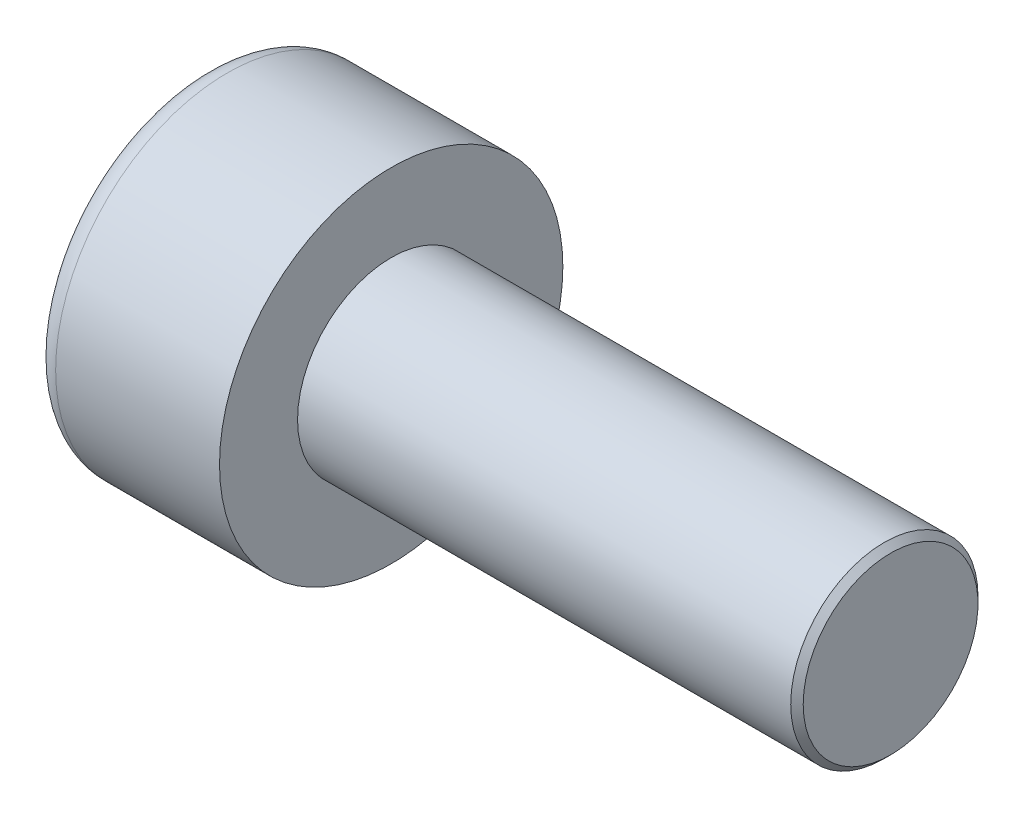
ISO-10303-21;
HEADER;
FILE_DESCRIPTION(('STEP AP214'),'2;1');
FILE_NAME('part.step','',(''),(''),'','','');
FILE_SCHEMA(('AUTOMOTIVE_DESIGN { 1 0 10303 214 1 1 1 1 }'));
ENDSEC;
DATA;
#1=APPLICATION_CONTEXT('core data for automotive mechanical design processes');
#2=APPLICATION_PROTOCOL_DEFINITION('international standard','automotive_design',2000,#1);
#3=PRODUCT_CONTEXT('',#1,'mechanical');
#4=PRODUCT('Part','Part','',(#3));
#5=PRODUCT_RELATED_PRODUCT_CATEGORY('part','',(#4));
#6=PRODUCT_DEFINITION_FORMATION('','',#4);
#7=PRODUCT_DEFINITION_CONTEXT('part definition',#1,'design');
#8=PRODUCT_DEFINITION('design','',#6,#7);
#9=PRODUCT_DEFINITION_SHAPE('','',#8);
#10=(LENGTH_UNIT() NAMED_UNIT(*) SI_UNIT(.MILLI.,.METRE.));
#11=(NAMED_UNIT(*) PLANE_ANGLE_UNIT() SI_UNIT($,.RADIAN.));
#12=(NAMED_UNIT(*) SI_UNIT($,.STERADIAN.) SOLID_ANGLE_UNIT());
#13=UNCERTAINTY_MEASURE_WITH_UNIT(LENGTH_MEASURE(1.E-05),#10,'distance_accuracy_value','');
#14=(GEOMETRIC_REPRESENTATION_CONTEXT(3) GLOBAL_UNCERTAINTY_ASSIGNED_CONTEXT((#13)) GLOBAL_UNIT_ASSIGNED_CONTEXT((#10,
#11,#12)) REPRESENTATION_CONTEXT('',''));
#15=CARTESIAN_POINT('',(0.,0.,0.));
#16=DIRECTION('',(0.,0.,1.));
#17=DIRECTION('',(1.,0.,0.));
#18=AXIS2_PLACEMENT_3D('',#15,#16,#17);
#19=CARTESIAN_POINT('',(1.30000000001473,0.,0.));
#20=DIRECTION('',(-1.,0.,0.));
#21=DIRECTION('',(0.,0.,1.));
#22=AXIS2_PLACEMENT_3D('',#19,#20,#21);
#23=CONICAL_SURFACE('',#22,1.25000000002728,1.04719755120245);
#24=CARTESIAN_POINT('',(2.02168783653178,0.,0.));
#25=VERTEX_POINT('',#24);
#26=VERTEX_LOOP('',#25);
#27=FACE_BOUND('',#26,.T.);
#28=CARTESIAN_POINT('',(1.30000000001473,0.,0.));
#29=DIRECTION('',(-1.,0.,0.));
#30=DIRECTION('',(0.,0.,1.));
#31=AXIS2_PLACEMENT_3D('',#28,#29,#30);
#32=CIRCLE('',#31,1.25000000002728);
#33=CARTESIAN_POINT('',(1.30000000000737,-0.625000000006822,1.08253175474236));
#34=VERTEX_POINT('',#33);
#35=CARTESIAN_POINT('',(1.30000000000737,0.625000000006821,1.08253175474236));
#36=VERTEX_POINT('',#35);
#37=EDGE_CURVE('E85',#34,#36,#32,.T.);
#38=ORIENTED_EDGE('',*,*,#37,.T.);
#39=CARTESIAN_POINT('',(1.30000000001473,0.,0.));
#40=DIRECTION('',(-1.,0.,0.));
#41=DIRECTION('',(0.,0.,1.));
#42=AXIS2_PLACEMENT_3D('',#39,#40,#41);
#43=CIRCLE('',#42,1.25000000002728);
#44=CARTESIAN_POINT('',(1.30000000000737,1.25000000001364,0.));
#45=VERTEX_POINT('',#44);
#46=EDGE_CURVE('E103',#36,#45,#43,.T.);
#47=ORIENTED_EDGE('',*,*,#46,.T.);
#48=CARTESIAN_POINT('',(1.30000000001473,0.,0.));
#49=DIRECTION('',(-1.,0.,0.));
#50=DIRECTION('',(0.,0.,1.));
#51=AXIS2_PLACEMENT_3D('',#48,#49,#50);
#52=CIRCLE('',#51,1.25000000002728);
#53=CARTESIAN_POINT('',(1.30000000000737,0.625000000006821,-1.08253175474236));
#54=VERTEX_POINT('',#53);
#55=EDGE_CURVE('E147',#45,#54,#52,.T.);
#56=ORIENTED_EDGE('',*,*,#55,.T.);
#57=CARTESIAN_POINT('',(1.30000000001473,0.,0.));
#58=DIRECTION('',(-1.,0.,0.));
#59=DIRECTION('',(0.,0.,1.));
#60=AXIS2_PLACEMENT_3D('',#57,#58,#59);
#61=CIRCLE('',#60,1.25000000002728);
#62=CARTESIAN_POINT('',(1.30000000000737,-0.625000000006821,-1.08253175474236));
#63=VERTEX_POINT('',#62);
#64=EDGE_CURVE('E135',#54,#63,#61,.T.);
#65=ORIENTED_EDGE('',*,*,#64,.T.);
#66=CARTESIAN_POINT('',(1.30000000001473,0.,0.));
#67=DIRECTION('',(-1.,0.,0.));
#68=DIRECTION('',(0.,0.,1.));
#69=AXIS2_PLACEMENT_3D('',#66,#67,#68);
#70=CIRCLE('',#69,1.25000000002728);
#71=CARTESIAN_POINT('',(1.30000000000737,-1.25000000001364,0.));
#72=VERTEX_POINT('',#71);
#73=EDGE_CURVE('E89',#63,#72,#70,.T.);
#74=ORIENTED_EDGE('',*,*,#73,.T.);
#75=CARTESIAN_POINT('',(1.30000000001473,0.,0.));
#76=DIRECTION('',(-1.,0.,0.));
#77=DIRECTION('',(0.,0.,1.));
#78=AXIS2_PLACEMENT_3D('',#75,#76,#77);
#79=CIRCLE('',#78,1.25000000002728);
#80=EDGE_CURVE('E83',#72,#34,#79,.T.);
#81=ORIENTED_EDGE('',*,*,#80,.T.);
#82=EDGE_LOOP('',(#38,#47,#56,#65,#74,#81));
#83=FACE_BOUND('',#82,.T.);
#84=ADVANCED_FACE('F17',(#27,#83),#23,.F.);
#85=CARTESIAN_POINT('',(1.3,0.,-1.44337567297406));
#86=DIRECTION('',(1.,0.,0.));
#87=DIRECTION('',(0.,0.,-1.));
#88=AXIS2_PLACEMENT_3D('',#85,#86,#87);
#89=PLANE('',#88);
#90=DIRECTION('',(0.,0.,1.));
#91=VECTOR('',#90,1.);
#92=CARTESIAN_POINT('',(1.3,-1.25,0.721687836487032));
#93=LINE('',#92,#91);
#94=CARTESIAN_POINT('',(1.3,-1.25,0.721687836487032));
#95=VERTEX_POINT('',#94);
#96=EDGE_CURVE('E109',#95,#72,#93,.F.);
#97=ORIENTED_EDGE('',*,*,#96,.F.);
#98=DIRECTION('',(0.,0.866025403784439,0.5));
#99=VECTOR('',#98,1.);
#100=CARTESIAN_POINT('',(1.3,0.,1.44337567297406));
#101=LINE('',#100,#99);
#102=EDGE_CURVE('E106',#34,#95,#101,.F.);
#103=ORIENTED_EDGE('',*,*,#102,.F.);
#104=ORIENTED_EDGE('',*,*,#80,.F.);
#105=EDGE_LOOP('',(#97,#103,#104));
#106=FACE_BOUND('',#105,.T.);
#107=ADVANCED_FACE('F107',(#106),#89,.F.);
#108=CARTESIAN_POINT('',(1.3,0.,-1.44337567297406));
#109=DIRECTION('',(1.,0.,0.));
#110=DIRECTION('',(0.,0.,-1.));
#111=AXIS2_PLACEMENT_3D('',#108,#109,#110);
#112=PLANE('',#111);
#113=DIRECTION('',(0.,0.866025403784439,0.5));
#114=VECTOR('',#113,1.);
#115=CARTESIAN_POINT('',(1.3,0.,1.44337567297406));
#116=LINE('',#115,#114);
#117=CARTESIAN_POINT('',(1.3,0.,1.44337567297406));
#118=VERTEX_POINT('',#117);
#119=EDGE_CURVE('E98',#118,#34,#116,.F.);
#120=ORIENTED_EDGE('',*,*,#119,.F.);
#121=DIRECTION('',(0.,0.866025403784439,-0.5));
#122=VECTOR('',#121,1.);
#123=CARTESIAN_POINT('',(1.3,1.25,0.721687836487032));
#124=LINE('',#123,#122);
#125=EDGE_CURVE('E101',#36,#118,#124,.F.);
#126=ORIENTED_EDGE('',*,*,#125,.F.);
#127=ORIENTED_EDGE('',*,*,#37,.F.);
#128=EDGE_LOOP('',(#120,#126,#127));
#129=FACE_BOUND('',#128,.T.);
#130=ADVANCED_FACE('F96',(#129),#112,.F.);
#131=CARTESIAN_POINT('',(1.3,0.,-1.44337567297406));
#132=DIRECTION('',(1.,0.,0.));
#133=DIRECTION('',(0.,0.,-1.));
#134=AXIS2_PLACEMENT_3D('',#131,#132,#133);
#135=PLANE('',#134);
#136=DIRECTION('',(0.,0.866025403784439,-0.5));
#137=VECTOR('',#136,1.);
#138=CARTESIAN_POINT('',(1.3,1.25,0.721687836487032));
#139=LINE('',#138,#137);
#140=CARTESIAN_POINT('',(1.3,1.25,0.721687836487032));
#141=VERTEX_POINT('',#140);
#142=EDGE_CURVE('E131',#141,#36,#139,.F.);
#143=ORIENTED_EDGE('',*,*,#142,.F.);
#144=DIRECTION('',(0.,0.,-1.));
#145=VECTOR('',#144,1.);
#146=CARTESIAN_POINT('',(1.3,1.25,-0.721687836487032));
#147=LINE('',#146,#145);
#148=EDGE_CURVE('E192',#45,#141,#147,.F.);
#149=ORIENTED_EDGE('',*,*,#148,.F.);
#150=ORIENTED_EDGE('',*,*,#46,.F.);
#151=EDGE_LOOP('',(#143,#149,#150));
#152=FACE_BOUND('',#151,.T.);
#153=ADVANCED_FACE('F401',(#152),#135,.F.);
#154=CARTESIAN_POINT('',(1.3,0.,-1.44337567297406));
#155=DIRECTION('',(1.,0.,0.));
#156=DIRECTION('',(0.,0.,-1.));
#157=AXIS2_PLACEMENT_3D('',#154,#155,#156);
#158=PLANE('',#157);
#159=DIRECTION('',(0.,0.,-1.));
#160=VECTOR('',#159,1.);
#161=CARTESIAN_POINT('',(1.3,1.25,-0.721687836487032));
#162=LINE('',#161,#160);
#163=CARTESIAN_POINT('',(1.3,1.25,-0.721687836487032));
#164=VERTEX_POINT('',#163);
#165=EDGE_CURVE('E189',#164,#45,#162,.F.);
#166=ORIENTED_EDGE('',*,*,#165,.F.);
#167=DIRECTION('',(0.,-0.866025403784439,-0.5));
#168=VECTOR('',#167,1.);
#169=CARTESIAN_POINT('',(1.3,0.,-1.44337567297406));
#170=LINE('',#169,#168);
#171=EDGE_CURVE('E177',#54,#164,#170,.F.);
#172=ORIENTED_EDGE('',*,*,#171,.F.);
#173=ORIENTED_EDGE('',*,*,#55,.F.);
#174=EDGE_LOOP('',(#166,#172,#173));
#175=FACE_BOUND('',#174,.T.);
#176=ADVANCED_FACE('F391',(#175),#158,.F.);
#177=CARTESIAN_POINT('',(1.3,0.,-1.44337567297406));
#178=DIRECTION('',(1.,0.,0.));
#179=DIRECTION('',(0.,0.,-1.));
#180=AXIS2_PLACEMENT_3D('',#177,#178,#179);
#181=PLANE('',#180);
#182=DIRECTION('',(0.,-0.866025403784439,0.5));
#183=VECTOR('',#182,1.);
#184=CARTESIAN_POINT('',(1.3,-1.25,-0.721687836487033));
#185=LINE('',#184,#183);
#186=CARTESIAN_POINT('',(1.3,-1.25,-0.721687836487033));
#187=VERTEX_POINT('',#186);
#188=EDGE_CURVE('E231',#187,#63,#185,.F.);
#189=ORIENTED_EDGE('',*,*,#188,.F.);
#190=DIRECTION('',(0.,0.,1.));
#191=VECTOR('',#190,1.);
#192=CARTESIAN_POINT('',(1.3,-1.25,0.721687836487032));
#193=LINE('',#192,#191);
#194=EDGE_CURVE('E119',#72,#187,#193,.F.);
#195=ORIENTED_EDGE('',*,*,#194,.F.);
#196=ORIENTED_EDGE('',*,*,#73,.F.);
#197=EDGE_LOOP('',(#189,#195,#196));
#198=FACE_BOUND('',#197,.T.);
#199=ADVANCED_FACE('F381',(#198),#181,.F.);
#200=CARTESIAN_POINT('',(1.3,0.,-1.44337567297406));
#201=DIRECTION('',(1.,0.,0.));
#202=DIRECTION('',(0.,0.,-1.));
#203=AXIS2_PLACEMENT_3D('',#200,#201,#202);
#204=PLANE('',#203);
#205=DIRECTION('',(0.,-0.866025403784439,-0.5));
#206=VECTOR('',#205,1.);
#207=CARTESIAN_POINT('',(1.3,0.,-1.44337567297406));
#208=LINE('',#207,#206);
#209=CARTESIAN_POINT('',(1.3,0.,-1.44337567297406));
#210=VERTEX_POINT('',#209);
#211=EDGE_CURVE('E181',#210,#54,#208,.F.);
#212=ORIENTED_EDGE('',*,*,#211,.F.);
#213=DIRECTION('',(0.,-0.866025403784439,0.5));
#214=VECTOR('',#213,1.);
#215=CARTESIAN_POINT('',(1.3,-1.25,-0.721687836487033));
#216=LINE('',#215,#214);
#217=EDGE_CURVE('E449',#63,#210,#216,.F.);
#218=ORIENTED_EDGE('',*,*,#217,.F.);
#219=ORIENTED_EDGE('',*,*,#64,.F.);
#220=EDGE_LOOP('',(#212,#218,#219));
#221=FACE_BOUND('',#220,.T.);
#222=ADVANCED_FACE('F371',(#221),#204,.F.);
#223=CARTESIAN_POINT('',(1.3,-1.25,0.721687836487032));
#224=DIRECTION('',(0.,1.,0.));
#225=DIRECTION('',(0.,0.,1.));
#226=AXIS2_PLACEMENT_3D('',#223,#224,#225);
#227=PLANE('',#226);
#228=ORIENTED_EDGE('',*,*,#194,.T.);
#229=DIRECTION('',(1.,0.,0.));
#230=VECTOR('',#229,1.);
#231=CARTESIAN_POINT('',(1.3,-1.25,-0.721687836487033));
#232=LINE('',#231,#230);
#233=CARTESIAN_POINT('',(0.,-1.25,-0.721687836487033));
#234=VERTEX_POINT('',#233);
#235=EDGE_CURVE('E186',#234,#187,#232,.T.);
#236=ORIENTED_EDGE('',*,*,#235,.F.);
#237=DIRECTION('',(0.,0.,-1.));
#238=VECTOR('',#237,1.);
#239=CARTESIAN_POINT('',(0.,-1.25,0.));
#240=LINE('',#239,#238);
#241=CARTESIAN_POINT('',(0.,-1.25,0.721687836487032));
#242=VERTEX_POINT('',#241);
#243=EDGE_CURVE('E170',#234,#242,#240,.F.);
#244=ORIENTED_EDGE('',*,*,#243,.T.);
#245=DIRECTION('',(1.,0.,0.));
#246=VECTOR('',#245,1.);
#247=CARTESIAN_POINT('',(1.3,-1.25,0.721687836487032));
#248=LINE('',#247,#246);
#249=EDGE_CURVE('E113',#95,#242,#248,.F.);
#250=ORIENTED_EDGE('',*,*,#249,.F.);
#251=ORIENTED_EDGE('',*,*,#96,.T.);
#252=EDGE_LOOP('',(#228,#236,#244,#250,#251));
#253=FACE_BOUND('',#252,.T.);
#254=ADVANCED_FACE('F362',(#253),#227,.T.);
#255=CARTESIAN_POINT('',(1.3,0.,1.44337567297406));
#256=DIRECTION('',(0.,0.5,-0.866025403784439));
#257=DIRECTION('',(0.,0.866025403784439,0.5));
#258=AXIS2_PLACEMENT_3D('',#255,#256,#257);
#259=PLANE('',#258);
#260=ORIENTED_EDGE('',*,*,#102,.T.);
#261=ORIENTED_EDGE('',*,*,#249,.T.);
#262=DIRECTION('',(0.,0.866025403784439,0.5));
#263=VECTOR('',#262,1.);
#264=CARTESIAN_POINT('',(0.,-1.25,0.721687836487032));
#265=LINE('',#264,#263);
#266=CARTESIAN_POINT('',(0.,0.,1.44337567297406));
#267=VERTEX_POINT('',#266);
#268=EDGE_CURVE('E173',#242,#267,#265,.T.);
#269=ORIENTED_EDGE('',*,*,#268,.T.);
#270=DIRECTION('',(1.,0.,0.));
#271=VECTOR('',#270,1.);
#272=CARTESIAN_POINT('',(1.3,0.,1.44337567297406));
#273=LINE('',#272,#271);
#274=EDGE_CURVE('E118',#118,#267,#273,.F.);
#275=ORIENTED_EDGE('',*,*,#274,.F.);
#276=ORIENTED_EDGE('',*,*,#119,.T.);
#277=EDGE_LOOP('',(#260,#261,#269,#275,#276));
#278=FACE_BOUND('',#277,.T.);
#279=ADVANCED_FACE('F115',(#278),#259,.T.);
#280=CARTESIAN_POINT('',(1.3,1.25,0.721687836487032));
#281=DIRECTION('',(0.,-0.5,-0.866025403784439));
#282=DIRECTION('',(0.,0.866025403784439,-0.5));
#283=AXIS2_PLACEMENT_3D('',#280,#281,#282);
#284=PLANE('',#283);
#285=ORIENTED_EDGE('',*,*,#125,.T.);
#286=ORIENTED_EDGE('',*,*,#274,.T.);
#287=DIRECTION('',(0.,0.866025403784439,-0.5));
#288=VECTOR('',#287,1.);
#289=CARTESIAN_POINT('',(0.,0.,1.44337567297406));
#290=LINE('',#289,#288);
#291=CARTESIAN_POINT('',(0.,1.25,0.721687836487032));
#292=VERTEX_POINT('',#291);
#293=EDGE_CURVE('E216',#267,#292,#290,.T.);
#294=ORIENTED_EDGE('',*,*,#293,.T.);
#295=DIRECTION('',(1.,0.,0.));
#296=VECTOR('',#295,1.);
#297=CARTESIAN_POINT('',(1.3,1.25,0.721687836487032));
#298=LINE('',#297,#296);
#299=EDGE_CURVE('E197',#141,#292,#298,.F.);
#300=ORIENTED_EDGE('',*,*,#299,.F.);
#301=ORIENTED_EDGE('',*,*,#142,.T.);
#302=EDGE_LOOP('',(#285,#286,#294,#300,#301));
#303=FACE_BOUND('',#302,.T.);
#304=ADVANCED_FACE('F213',(#303),#284,.T.);
#305=CARTESIAN_POINT('',(1.3,1.25,-0.721687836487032));
#306=DIRECTION('',(0.,-1.,0.));
#307=DIRECTION('',(0.,0.,-1.));
#308=AXIS2_PLACEMENT_3D('',#305,#306,#307);
#309=PLANE('',#308);
#310=ORIENTED_EDGE('',*,*,#148,.T.);
#311=ORIENTED_EDGE('',*,*,#299,.T.);
#312=DIRECTION('',(0.,0.,-1.));
#313=VECTOR('',#312,1.);
#314=CARTESIAN_POINT('',(0.,1.25,0.));
#315=LINE('',#314,#313);
#316=CARTESIAN_POINT('',(0.,1.25,-0.721687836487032));
#317=VERTEX_POINT('',#316);
#318=EDGE_CURVE('E163',#292,#317,#315,.T.);
#319=ORIENTED_EDGE('',*,*,#318,.T.);
#320=DIRECTION('',(1.,0.,0.));
#321=VECTOR('',#320,1.);
#322=CARTESIAN_POINT('',(1.3,1.25,-0.721687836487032));
#323=LINE('',#322,#321);
#324=EDGE_CURVE('E180',#164,#317,#323,.F.);
#325=ORIENTED_EDGE('',*,*,#324,.F.);
#326=ORIENTED_EDGE('',*,*,#165,.T.);
#327=EDGE_LOOP('',(#310,#311,#319,#325,#326));
#328=FACE_BOUND('',#327,.T.);
#329=ADVANCED_FACE('F335',(#328),#309,.T.);
#330=CARTESIAN_POINT('',(1.3,0.,-1.44337567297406));
#331=DIRECTION('',(0.,-0.5,0.866025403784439));
#332=DIRECTION('',(0.,-0.866025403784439,-0.5));
#333=AXIS2_PLACEMENT_3D('',#330,#331,#332);
#334=PLANE('',#333);
#335=ORIENTED_EDGE('',*,*,#171,.T.);
#336=ORIENTED_EDGE('',*,*,#324,.T.);
#337=DIRECTION('',(0.,-0.866025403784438,-0.5));
#338=VECTOR('',#337,1.);
#339=CARTESIAN_POINT('',(0.,1.25,-0.721687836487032));
#340=LINE('',#339,#338);
#341=CARTESIAN_POINT('',(0.,0.,-1.44337567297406));
#342=VERTEX_POINT('',#341);
#343=EDGE_CURVE('E155',#317,#342,#340,.T.);
#344=ORIENTED_EDGE('',*,*,#343,.T.);
#345=DIRECTION('',(1.,0.,0.));
#346=VECTOR('',#345,1.);
#347=CARTESIAN_POINT('',(1.3,0.,-1.44337567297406));
#348=LINE('',#347,#346);
#349=EDGE_CURVE('E174',#210,#342,#348,.F.);
#350=ORIENTED_EDGE('',*,*,#349,.F.);
#351=ORIENTED_EDGE('',*,*,#211,.T.);
#352=EDGE_LOOP('',(#335,#336,#344,#350,#351));
#353=FACE_BOUND('',#352,.T.);
#354=ADVANCED_FACE('F275',(#353),#334,.T.);
#355=CARTESIAN_POINT('',(1.3,-1.25,-0.721687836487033));
#356=DIRECTION('',(0.,0.5,0.866025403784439));
#357=DIRECTION('',(0.,-0.866025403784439,0.5));
#358=AXIS2_PLACEMENT_3D('',#355,#356,#357);
#359=PLANE('',#358);
#360=ORIENTED_EDGE('',*,*,#217,.T.);
#361=ORIENTED_EDGE('',*,*,#349,.T.);
#362=DIRECTION('',(0.,-0.866025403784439,0.5));
#363=VECTOR('',#362,1.);
#364=CARTESIAN_POINT('',(0.,0.,-1.44337567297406));
#365=LINE('',#364,#363);
#366=EDGE_CURVE('E153',#342,#234,#365,.T.);
#367=ORIENTED_EDGE('',*,*,#366,.T.);
#368=ORIENTED_EDGE('',*,*,#235,.T.);
#369=ORIENTED_EDGE('',*,*,#188,.T.);
#370=EDGE_LOOP('',(#360,#361,#367,#368,#369));
#371=FACE_BOUND('',#370,.T.);
#372=ADVANCED_FACE('F270',(#371),#359,.T.);
#373=CARTESIAN_POINT('',(0.,0.,0.));
#374=DIRECTION('',(1.,0.,0.));
#375=DIRECTION('',(0.,0.,-1.));
#376=AXIS2_PLACEMENT_3D('',#373,#374,#375);
#377=PLANE('',#376);
#378=ORIENTED_EDGE('',*,*,#343,.F.);
#379=ORIENTED_EDGE('',*,*,#318,.F.);
#380=ORIENTED_EDGE('',*,*,#293,.F.);
#381=ORIENTED_EDGE('',*,*,#268,.F.);
#382=ORIENTED_EDGE('',*,*,#243,.F.);
#383=ORIENTED_EDGE('',*,*,#366,.F.);
#384=EDGE_LOOP('',(#378,#379,#380,#381,#382,#383));
#385=FACE_BOUND('',#384,.T.);
#386=CARTESIAN_POINT('',(0.,0.,0.));
#387=DIRECTION('',(1.,0.,0.));
#388=DIRECTION('',(0.,0.,-1.));
#389=AXIS2_PLACEMENT_3D('',#386,#387,#388);
#390=CIRCLE('',#389,2.375);
#391=CARTESIAN_POINT('',(0.,0.,-2.375));
#392=VERTEX_POINT('',#391);
#393=CARTESIAN_POINT('',(0.,0.,2.375));
#394=VERTEX_POINT('',#393);
#395=EDGE_CURVE('E151',#392,#394,#390,.T.);
#396=ORIENTED_EDGE('',*,*,#395,.F.);
#397=CARTESIAN_POINT('',(0.,0.,0.));
#398=DIRECTION('',(1.,0.,0.));
#399=DIRECTION('',(0.,0.,1.));
#400=AXIS2_PLACEMENT_3D('',#397,#398,#399);
#401=CIRCLE('',#400,2.375);
#402=EDGE_CURVE('E36',#394,#392,#401,.T.);
#403=ORIENTED_EDGE('',*,*,#402,.F.);
#404=EDGE_LOOP('',(#396,#403));
#405=FACE_BOUND('',#404,.T.);
#406=ADVANCED_FACE('F222',(#385,#405),#377,.F.);
#407=CARTESIAN_POINT('',(0.375,0.,0.));
#408=DIRECTION('',(1.,0.,0.));
#409=DIRECTION('',(0.,0.,-1.));
#410=AXIS2_PLACEMENT_3D('',#407,#408,#409);
#411=TOROIDAL_SURFACE('',#410,2.375,0.375);
#412=CARTESIAN_POINT('',(0.375,0.,0.));
#413=DIRECTION('',(-1.,0.,0.));
#414=DIRECTION('',(0.,0.,1.));
#415=AXIS2_PLACEMENT_3D('',#412,#413,#414);
#416=CIRCLE('',#415,2.75);
#417=CARTESIAN_POINT('',(0.375,0.,2.75));
#418=VERTEX_POINT('',#417);
#419=EDGE_CURVE('E144',#418,#418,#416,.F.);
#420=ORIENTED_EDGE('',*,*,#419,.F.);
#421=EDGE_LOOP('',(#420));
#422=FACE_BOUND('',#421,.T.);
#423=ORIENTED_EDGE('',*,*,#395,.T.);
#424=ORIENTED_EDGE('',*,*,#402,.T.);
#425=EDGE_LOOP('',(#423,#424));
#426=FACE_BOUND('',#425,.T.);
#427=ADVANCED_FACE('F150',(#422,#426),#411,.T.);
#428=CARTESIAN_POINT('',(11.,0.,0.));
#429=DIRECTION('',(1.,0.,0.));
#430=DIRECTION('',(0.,0.,-1.));
#431=AXIS2_PLACEMENT_3D('',#428,#429,#430);
#432=PLANE('',#431);
#433=CARTESIAN_POINT('',(10.9999999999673,0.,0.));
#434=DIRECTION('',(-1.,0.,0.));
#435=DIRECTION('',(0.,0.,1.));
#436=AXIS2_PLACEMENT_3D('',#433,#434,#435);
#437=CIRCLE('',#436,1.39999999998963);
#438=CARTESIAN_POINT('',(10.9999999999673,0.,1.39999999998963));
#439=VERTEX_POINT('',#438);
#440=EDGE_CURVE('E141',#439,#439,#437,.T.);
#441=ORIENTED_EDGE('',*,*,#440,.F.);
#442=EDGE_LOOP('',(#441));
#443=FACE_BOUND('',#442,.T.);
#444=ADVANCED_FACE('F243',(#443),#432,.T.);
#445=CARTESIAN_POINT('',(3.,0.,0.));
#446=DIRECTION('',(-1.,0.,0.));
#447=DIRECTION('',(0.,0.,1.));
#448=AXIS2_PLACEMENT_3D('',#445,#446,#447);
#449=CYLINDRICAL_SURFACE('',#448,2.75);
#450=ORIENTED_EDGE('',*,*,#419,.T.);
#451=EDGE_LOOP('',(#450));
#452=FACE_BOUND('',#451,.T.);
#453=CARTESIAN_POINT('',(3.,0.,0.));
#454=DIRECTION('',(-1.,0.,0.));
#455=DIRECTION('',(0.,0.,1.));
#456=AXIS2_PLACEMENT_3D('',#453,#454,#455);
#457=CIRCLE('',#456,2.75);
#458=CARTESIAN_POINT('',(3.,0.,2.75));
#459=VERTEX_POINT('',#458);
#460=EDGE_CURVE('E138',#459,#459,#457,.F.);
#461=ORIENTED_EDGE('',*,*,#460,.F.);
#462=EDGE_LOOP('',(#461));
#463=FACE_BOUND('',#462,.T.);
#464=ADVANCED_FACE('F290',(#452,#463),#449,.T.);
#465=CARTESIAN_POINT('',(10.8999999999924,0.,0.));
#466=DIRECTION('',(-1.,0.,0.));
#467=DIRECTION('',(0.,0.,1.));
#468=AXIS2_PLACEMENT_3D('',#465,#466,#467);
#469=CONICAL_SURFACE('',#468,1.50000000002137,0.785398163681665);
#470=CARTESIAN_POINT('',(10.9,0.,0.));
#471=DIRECTION('',(-1.,0.,0.));
#472=DIRECTION('',(0.,0.,1.));
#473=AXIS2_PLACEMENT_3D('',#470,#471,#472);
#474=CIRCLE('',#473,1.5);
#475=CARTESIAN_POINT('',(10.9,0.,1.5));
#476=VERTEX_POINT('',#475);
#477=EDGE_CURVE('E28',#476,#476,#474,.T.);
#478=ORIENTED_EDGE('',*,*,#477,.F.);
#479=EDGE_LOOP('',(#478));
#480=FACE_BOUND('',#479,.T.);
#481=ORIENTED_EDGE('',*,*,#440,.T.);
#482=EDGE_LOOP('',(#481));
#483=FACE_BOUND('',#482,.T.);
#484=ADVANCED_FACE('F284',(#480,#483),#469,.T.);
#485=CARTESIAN_POINT('',(3.,0.,0.));
#486=DIRECTION('',(1.,0.,0.));
#487=DIRECTION('',(0.,0.,-1.));
#488=AXIS2_PLACEMENT_3D('',#485,#486,#487);
#489=PLANE('',#488);
#490=CARTESIAN_POINT('',(3.,0.,0.));
#491=DIRECTION('',(-1.,0.,0.));
#492=DIRECTION('',(0.,0.,1.));
#493=AXIS2_PLACEMENT_3D('',#490,#491,#492);
#494=CIRCLE('',#493,1.5);
#495=CARTESIAN_POINT('',(3.,0.,1.5));
#496=VERTEX_POINT('',#495);
#497=EDGE_CURVE('E11',#496,#496,#494,.F.);
#498=ORIENTED_EDGE('',*,*,#497,.F.);
#499=EDGE_LOOP('',(#498));
#500=FACE_BOUND('',#499,.T.);
#501=ORIENTED_EDGE('',*,*,#460,.T.);
#502=EDGE_LOOP('',(#501));
#503=FACE_BOUND('',#502,.T.);
#504=ADVANCED_FACE('F278',(#500,#503),#489,.T.);
#505=CARTESIAN_POINT('',(11.,0.,0.));
#506=DIRECTION('',(-1.,0.,0.));
#507=DIRECTION('',(0.,0.,1.));
#508=AXIS2_PLACEMENT_3D('',#505,#506,#507);
#509=CYLINDRICAL_SURFACE('',#508,1.5);
#510=ORIENTED_EDGE('',*,*,#497,.T.);
#511=EDGE_LOOP('',(#510));
#512=FACE_BOUND('',#511,.T.);
#513=ORIENTED_EDGE('',*,*,#477,.T.);
#514=EDGE_LOOP('',(#513));
#515=FACE_BOUND('',#514,.T.);
#516=ADVANCED_FACE('F276',(#512,#515),#509,.T.);
#517=CLOSED_SHELL('',(#84,#107,#130,#153,#176,#199,#222,#254,#279,#304,#329,#354,#372,#406,#427,
#444,#464,#484,#504,#516));
#518=MANIFOLD_SOLID_BREP('B1',#517);
#519=ADVANCED_BREP_SHAPE_REPRESENTATION('',(#18,#518),#14);
#520=SHAPE_DEFINITION_REPRESENTATION(#9,#519);
ENDSEC;
END-ISO-10303-21;
